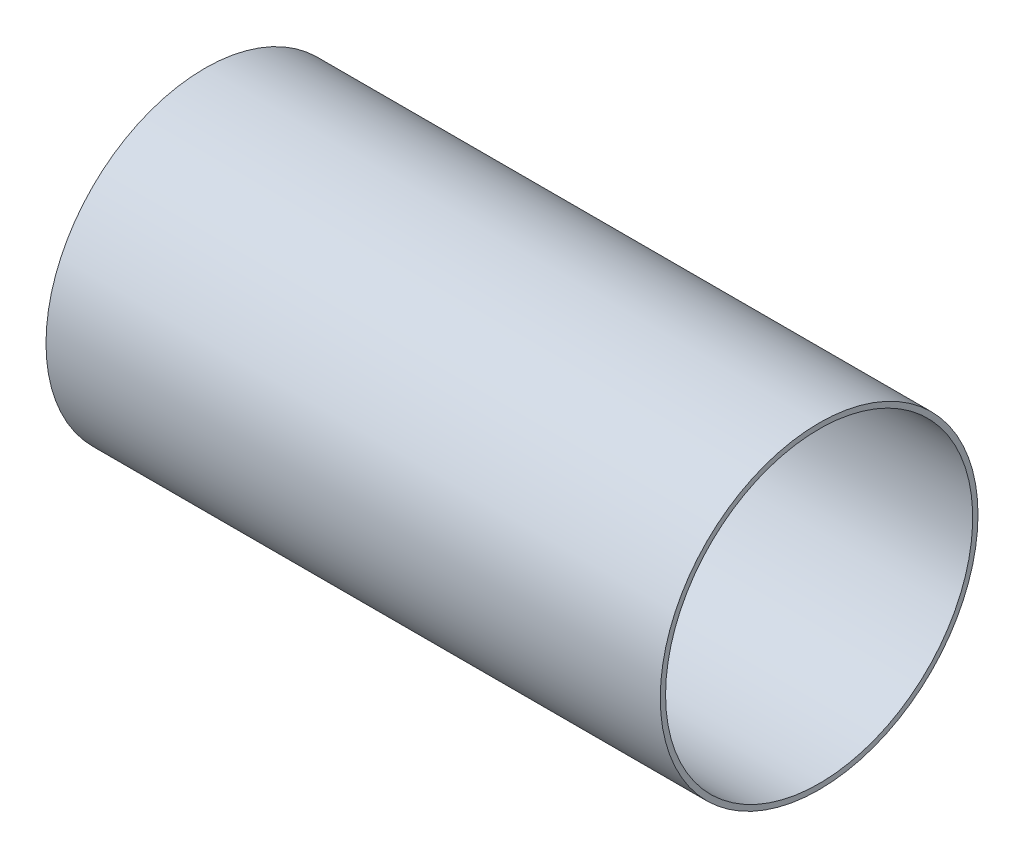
ISO-10303-21;
HEADER;
FILE_DESCRIPTION(('STEP AP214'),'2;1');
FILE_NAME('part.step','',(''),(''),'','','');
FILE_SCHEMA(('AUTOMOTIVE_DESIGN { 1 0 10303 214 1 1 1 1 }'));
ENDSEC;
DATA;
#1=APPLICATION_CONTEXT('core data for automotive mechanical design processes');
#2=APPLICATION_PROTOCOL_DEFINITION('international standard','automotive_design',2000,#1);
#3=PRODUCT_CONTEXT('',#1,'mechanical');
#4=PRODUCT('Part','Part','',(#3));
#5=PRODUCT_RELATED_PRODUCT_CATEGORY('part','',(#4));
#6=PRODUCT_DEFINITION_FORMATION('','',#4);
#7=PRODUCT_DEFINITION_CONTEXT('part definition',#1,'design');
#8=PRODUCT_DEFINITION('design','',#6,#7);
#9=PRODUCT_DEFINITION_SHAPE('','',#8);
#10=(LENGTH_UNIT() NAMED_UNIT(*) SI_UNIT(.MILLI.,.METRE.));
#11=(NAMED_UNIT(*) PLANE_ANGLE_UNIT() SI_UNIT($,.RADIAN.));
#12=(NAMED_UNIT(*) SI_UNIT($,.STERADIAN.) SOLID_ANGLE_UNIT());
#13=UNCERTAINTY_MEASURE_WITH_UNIT(LENGTH_MEASURE(1.E-05),#10,'distance_accuracy_value','');
#14=(GEOMETRIC_REPRESENTATION_CONTEXT(3) GLOBAL_UNCERTAINTY_ASSIGNED_CONTEXT((#13)) GLOBAL_UNIT_ASSIGNED_CONTEXT((#10,
#11,#12)) REPRESENTATION_CONTEXT('',''));
#15=CARTESIAN_POINT('',(0.,0.,0.));
#16=DIRECTION('',(0.,0.,1.));
#17=DIRECTION('',(1.,0.,0.));
#18=AXIS2_PLACEMENT_3D('',#15,#16,#17);
#19=CARTESIAN_POINT('',(0.,0.,0.));
#20=DIRECTION('',(-1.,0.,0.));
#21=DIRECTION('',(0.,0.,1.));
#22=AXIS2_PLACEMENT_3D('',#19,#20,#21);
#23=CYLINDRICAL_SURFACE('',#22,0.8);
#24=CARTESIAN_POINT('',(0.8,0.,0.));
#25=DIRECTION('',(-1.,0.,0.));
#26=DIRECTION('',(0.,0.,1.));
#27=AXIS2_PLACEMENT_3D('',#24,#25,#26);
#28=CIRCLE('',#27,0.8);
#29=CARTESIAN_POINT('',(0.8,0.,0.8));
#30=VERTEX_POINT('',#29);
#31=EDGE_CURVE('E57',#30,#30,#28,.T.);
#32=ORIENTED_EDGE('',*,*,#31,.F.);
#33=EDGE_LOOP('',(#32));
#34=FACE_BOUND('',#33,.T.);
#35=CARTESIAN_POINT('',(0.,0.,0.));
#36=DIRECTION('',(-1.,0.,0.));
#37=DIRECTION('',(0.,0.,1.));
#38=AXIS2_PLACEMENT_3D('',#35,#36,#37);
#39=CIRCLE('',#38,0.8);
#40=CARTESIAN_POINT('',(0.,0.,0.8));
#41=VERTEX_POINT('',#40);
#42=EDGE_CURVE('E10',#41,#41,#39,.T.);
#43=ORIENTED_EDGE('',*,*,#42,.T.);
#44=EDGE_LOOP('',(#43));
#45=FACE_BOUND('',#44,.T.);
#46=ADVANCED_FACE('F29',(#34,#45),#23,.F.);
#47=CARTESIAN_POINT('',(0.,3.,0.));
#48=DIRECTION('',(1.,0.,0.));
#49=DIRECTION('',(0.,0.,-1.));
#50=AXIS2_PLACEMENT_3D('',#47,#48,#49);
#51=PLANE('',#50);
#52=ORIENTED_EDGE('',*,*,#42,.F.);
#53=EDGE_LOOP('',(#52));
#54=FACE_BOUND('',#53,.T.);
#55=CARTESIAN_POINT('',(0.,0.,0.));
#56=DIRECTION('',(-1.,0.,0.));
#57=DIRECTION('',(0.,0.,1.));
#58=AXIS2_PLACEMENT_3D('',#55,#56,#57);
#59=CIRCLE('',#58,3.);
#60=CARTESIAN_POINT('',(0.,0.,3.));
#61=VERTEX_POINT('',#60);
#62=EDGE_CURVE('E35',#61,#61,#59,.T.);
#63=ORIENTED_EDGE('',*,*,#62,.T.);
#64=EDGE_LOOP('',(#63));
#65=FACE_BOUND('',#64,.T.);
#66=ADVANCED_FACE('F65',(#54,#65),#51,.F.);
#67=CARTESIAN_POINT('',(0.,0.,0.));
#68=DIRECTION('',(-1.,0.,0.));
#69=DIRECTION('',(0.,0.,1.));
#70=AXIS2_PLACEMENT_3D('',#67,#68,#69);
#71=CYLINDRICAL_SURFACE('',#70,3.);
#72=ORIENTED_EDGE('',*,*,#62,.F.);
#73=EDGE_LOOP('',(#72));
#74=FACE_BOUND('',#73,.T.);
#75=CARTESIAN_POINT('',(11.6,0.,0.));
#76=DIRECTION('',(-1.,0.,0.));
#77=DIRECTION('',(0.,0.,1.));
#78=AXIS2_PLACEMENT_3D('',#75,#76,#77);
#79=CIRCLE('',#78,3.);
#80=CARTESIAN_POINT('',(11.6,0.,3.));
#81=VERTEX_POINT('',#80);
#82=EDGE_CURVE('E39',#81,#81,#79,.T.);
#83=ORIENTED_EDGE('',*,*,#82,.T.);
#84=EDGE_LOOP('',(#83));
#85=FACE_BOUND('',#84,.T.);
#86=ADVANCED_FACE('F69',(#74,#85),#71,.T.);
#87=CARTESIAN_POINT('',(11.6,3.,0.));
#88=DIRECTION('',(1.,0.,0.));
#89=DIRECTION('',(0.,0.,-1.));
#90=AXIS2_PLACEMENT_3D('',#87,#88,#89);
#91=PLANE('',#90);
#92=CARTESIAN_POINT('',(11.6,0.,0.));
#93=DIRECTION('',(-1.,0.,0.));
#94=DIRECTION('',(0.,0.,1.));
#95=AXIS2_PLACEMENT_3D('',#92,#93,#94);
#96=CIRCLE('',#95,2.9);
#97=CARTESIAN_POINT('',(11.6,0.,2.9));
#98=VERTEX_POINT('',#97);
#99=EDGE_CURVE('E43',#98,#98,#96,.T.);
#100=ORIENTED_EDGE('',*,*,#99,.T.);
#101=EDGE_LOOP('',(#100));
#102=FACE_BOUND('',#101,.T.);
#103=ORIENTED_EDGE('',*,*,#82,.F.);
#104=EDGE_LOOP('',(#103));
#105=FACE_BOUND('',#104,.T.);
#106=ADVANCED_FACE('F74',(#102,#105),#91,.T.);
#107=CARTESIAN_POINT('',(0.,0.,0.));
#108=DIRECTION('',(-1.,0.,0.));
#109=DIRECTION('',(0.,0.,1.));
#110=AXIS2_PLACEMENT_3D('',#107,#108,#109);
#111=CYLINDRICAL_SURFACE('',#110,2.9);
#112=CARTESIAN_POINT('',(0.1,0.,0.));
#113=DIRECTION('',(-1.,0.,0.));
#114=DIRECTION('',(0.,0.,1.));
#115=AXIS2_PLACEMENT_3D('',#112,#113,#114);
#116=CIRCLE('',#115,2.9);
#117=CARTESIAN_POINT('',(0.1,0.,2.9));
#118=VERTEX_POINT('',#117);
#119=EDGE_CURVE('E48',#118,#118,#116,.T.);
#120=ORIENTED_EDGE('',*,*,#119,.T.);
#121=EDGE_LOOP('',(#120));
#122=FACE_BOUND('',#121,.T.);
#123=ORIENTED_EDGE('',*,*,#99,.F.);
#124=EDGE_LOOP('',(#123));
#125=FACE_BOUND('',#124,.T.);
#126=ADVANCED_FACE('F80',(#122,#125),#111,.F.);
#127=CARTESIAN_POINT('',(0.1,3.,0.));
#128=DIRECTION('',(1.,0.,0.));
#129=DIRECTION('',(0.,0.,-1.));
#130=AXIS2_PLACEMENT_3D('',#127,#128,#129);
#131=PLANE('',#130);
#132=CARTESIAN_POINT('',(0.1,0.,0.));
#133=DIRECTION('',(-1.,0.,0.));
#134=DIRECTION('',(0.,0.,1.));
#135=AXIS2_PLACEMENT_3D('',#132,#133,#134);
#136=CIRCLE('',#135,0.9);
#137=CARTESIAN_POINT('',(0.1,0.,0.9));
#138=VERTEX_POINT('',#137);
#139=EDGE_CURVE('E51',#138,#138,#136,.T.);
#140=ORIENTED_EDGE('',*,*,#139,.T.);
#141=EDGE_LOOP('',(#140));
#142=FACE_BOUND('',#141,.T.);
#143=ORIENTED_EDGE('',*,*,#119,.F.);
#144=EDGE_LOOP('',(#143));
#145=FACE_BOUND('',#144,.T.);
#146=ADVANCED_FACE('F84',(#142,#145),#131,.T.);
#147=CARTESIAN_POINT('',(0.,0.,0.));
#148=DIRECTION('',(-1.,0.,0.));
#149=DIRECTION('',(0.,0.,1.));
#150=AXIS2_PLACEMENT_3D('',#147,#148,#149);
#151=CYLINDRICAL_SURFACE('',#150,0.9);
#152=CARTESIAN_POINT('',(0.8,0.,0.));
#153=DIRECTION('',(-1.,0.,0.));
#154=DIRECTION('',(0.,0.,1.));
#155=AXIS2_PLACEMENT_3D('',#152,#153,#154);
#156=CIRCLE('',#155,0.9);
#157=CARTESIAN_POINT('',(0.8,0.,0.9));
#158=VERTEX_POINT('',#157);
#159=EDGE_CURVE('E54',#158,#158,#156,.T.);
#160=ORIENTED_EDGE('',*,*,#159,.T.);
#161=EDGE_LOOP('',(#160));
#162=FACE_BOUND('',#161,.T.);
#163=ORIENTED_EDGE('',*,*,#139,.F.);
#164=EDGE_LOOP('',(#163));
#165=FACE_BOUND('',#164,.T.);
#166=ADVANCED_FACE('F88',(#162,#165),#151,.T.);
#167=CARTESIAN_POINT('',(0.8,0.9,0.));
#168=DIRECTION('',(1.,0.,0.));
#169=DIRECTION('',(0.,0.,-1.));
#170=AXIS2_PLACEMENT_3D('',#167,#168,#169);
#171=PLANE('',#170);
#172=ORIENTED_EDGE('',*,*,#31,.T.);
#173=EDGE_LOOP('',(#172));
#174=FACE_BOUND('',#173,.T.);
#175=ORIENTED_EDGE('',*,*,#159,.F.);
#176=EDGE_LOOP('',(#175));
#177=FACE_BOUND('',#176,.T.);
#178=ADVANCED_FACE('F61',(#174,#177),#171,.T.);
#179=CLOSED_SHELL('',(#46,#66,#86,#106,#126,#146,#166,#178));
#180=MANIFOLD_SOLID_BREP('B2',#179);
#181=ADVANCED_BREP_SHAPE_REPRESENTATION('',(#18,#180),#14);
#182=SHAPE_DEFINITION_REPRESENTATION(#9,#181);
ENDSEC;
END-ISO-10303-21;
